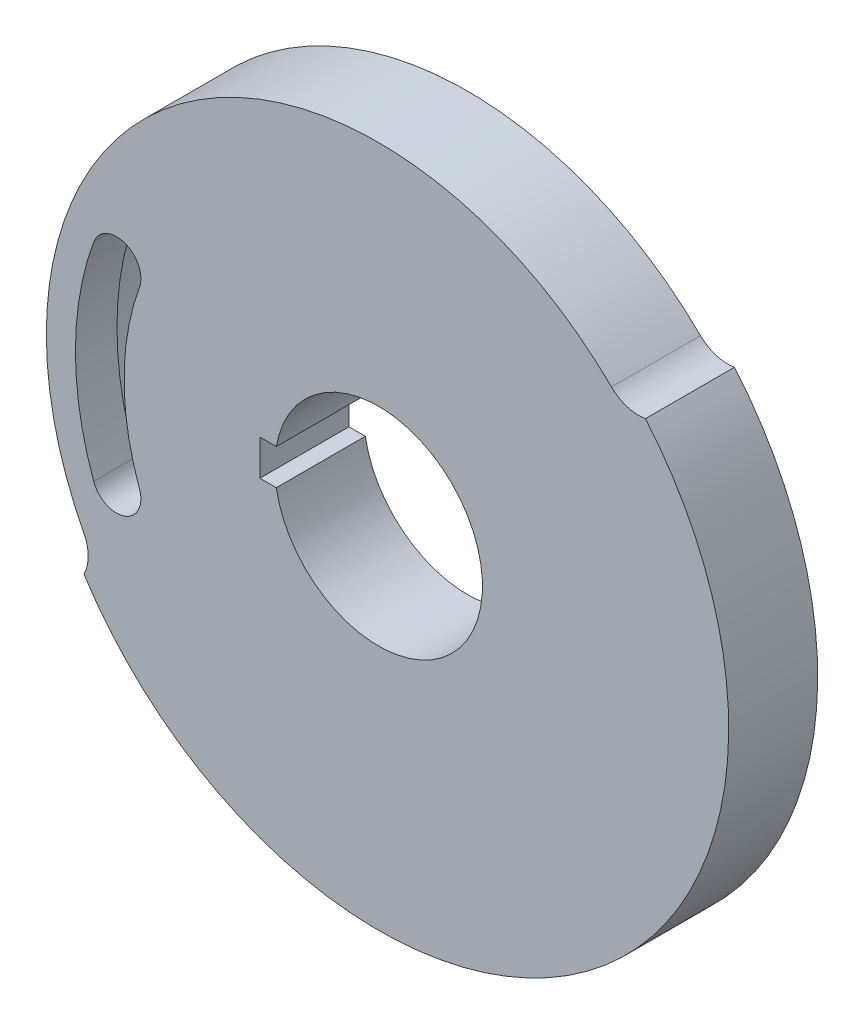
ISO-10303-21;
HEADER;
FILE_DESCRIPTION(('STEP AP214'),'2;1');
FILE_NAME('part.step','',(''),(''),'','','');
FILE_SCHEMA(('AUTOMOTIVE_DESIGN { 1 0 10303 214 1 1 1 1 }'));
ENDSEC;
DATA;
#1=APPLICATION_CONTEXT('core data for automotive mechanical design processes');
#2=APPLICATION_PROTOCOL_DEFINITION('international standard','automotive_design',2000,#1);
#3=PRODUCT_CONTEXT('',#1,'mechanical');
#4=PRODUCT('Part','Part','',(#3));
#5=PRODUCT_RELATED_PRODUCT_CATEGORY('part','',(#4));
#6=PRODUCT_DEFINITION_FORMATION('','',#4);
#7=PRODUCT_DEFINITION_CONTEXT('part definition',#1,'design');
#8=PRODUCT_DEFINITION('design','',#6,#7);
#9=PRODUCT_DEFINITION_SHAPE('','',#8);
#10=(LENGTH_UNIT() NAMED_UNIT(*) SI_UNIT(.MILLI.,.METRE.));
#11=(NAMED_UNIT(*) PLANE_ANGLE_UNIT() SI_UNIT($,.RADIAN.));
#12=(NAMED_UNIT(*) SI_UNIT($,.STERADIAN.) SOLID_ANGLE_UNIT());
#13=UNCERTAINTY_MEASURE_WITH_UNIT(LENGTH_MEASURE(1.E-05),#10,'distance_accuracy_value','');
#14=(GEOMETRIC_REPRESENTATION_CONTEXT(3) GLOBAL_UNCERTAINTY_ASSIGNED_CONTEXT((#13)) GLOBAL_UNIT_ASSIGNED_CONTEXT((#10,
#11,#12)) REPRESENTATION_CONTEXT('',''));
#15=CARTESIAN_POINT('',(0.,0.,0.));
#16=DIRECTION('',(0.,0.,1.));
#17=DIRECTION('',(1.,0.,0.));
#18=AXIS2_PLACEMENT_3D('',#15,#16,#17);
#19=CARTESIAN_POINT('',(0.,0.,15.));
#20=DIRECTION('',(0.,0.,-1.));
#21=DIRECTION('',(-1.00000000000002,0.,0.));
#22=AXIS2_PLACEMENT_3D('',#19,#20,#21);
#23=CYLINDRICAL_SURFACE('',#22,42.9);
#24=DIRECTION('',(0.,0.,-1.));
#25=VECTOR('',#24,1.);
#26=CARTESIAN_POINT('',(-40.312813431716,14.6726641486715,15.));
#27=LINE('',#26,#25);
#28=CARTESIAN_POINT('',(-40.312813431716,14.6726641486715,15.));
#29=VERTEX_POINT('',#28);
#30=CARTESIAN_POINT('',(-40.312813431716,14.6726641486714,7.99999999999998));
#31=VERTEX_POINT('',#30);
#32=EDGE_CURVE('E191',#29,#31,#27,.T.);
#33=ORIENTED_EDGE('',*,*,#32,.T.);
#34=CARTESIAN_POINT('',(0.,0.,8.00000000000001));
#35=DIRECTION('',(0.,0.,-1.));
#36=DIRECTION('',(-1.00000000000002,0.,0.));
#37=AXIS2_PLACEMENT_3D('',#34,#35,#36);
#38=CIRCLE('',#37,42.9);
#39=CARTESIAN_POINT('',(-40.312813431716,-14.6726641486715,8.00000000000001));
#40=VERTEX_POINT('',#39);
#41=EDGE_CURVE('E170',#31,#40,#38,.F.);
#42=ORIENTED_EDGE('',*,*,#41,.T.);
#43=DIRECTION('',(0.,0.,-1.));
#44=VECTOR('',#43,1.);
#45=CARTESIAN_POINT('',(-40.312813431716,-14.6726641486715,15.));
#46=LINE('',#45,#44);
#47=CARTESIAN_POINT('',(-40.312813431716,-14.6726641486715,15.));
#48=VERTEX_POINT('',#47);
#49=EDGE_CURVE('E182',#48,#40,#46,.T.);
#50=ORIENTED_EDGE('',*,*,#49,.F.);
#51=CARTESIAN_POINT('',(0.,0.,15.));
#52=DIRECTION('',(0.,0.,-1.));
#53=DIRECTION('',(1.00000000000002,0.,0.));
#54=AXIS2_PLACEMENT_3D('',#51,#52,#53);
#55=CIRCLE('',#54,42.9);
#56=EDGE_CURVE('E173',#48,#29,#55,.T.);
#57=ORIENTED_EDGE('',*,*,#56,.T.);
#58=EDGE_LOOP('',(#33,#42,#50,#57));
#59=FACE_BOUND('',#58,.T.);
#60=ADVANCED_FACE('F16',(#59),#23,.T.);
#61=CARTESIAN_POINT('',(-44.1655531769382,16.0749467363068,15.));
#62=DIRECTION('',(0.,0.,-1.));
#63=DIRECTION('',(-1.00000000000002,0.,0.));
#64=AXIS2_PLACEMENT_3D('',#61,#62,#63);
#65=CYLINDRICAL_SURFACE('',#64,4.1);
#66=DIRECTION('',(0.,0.,-1.));
#67=VECTOR('',#66,1.);
#68=CARTESIAN_POINT('',(-48.0182929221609,17.4772293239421,15.));
#69=LINE('',#68,#67);
#70=CARTESIAN_POINT('',(-48.0182929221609,17.4772293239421,15.));
#71=VERTEX_POINT('',#70);
#72=CARTESIAN_POINT('',(-48.0182929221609,17.4772293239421,7.99999999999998));
#73=VERTEX_POINT('',#72);
#74=EDGE_CURVE('E188',#71,#73,#69,.T.);
#75=ORIENTED_EDGE('',*,*,#74,.T.);
#76=CARTESIAN_POINT('',(-44.1655531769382,16.0749467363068,7.99999999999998));
#77=DIRECTION('',(0.,0.,-1.));
#78=DIRECTION('',(-1.00000000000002,0.,0.));
#79=AXIS2_PLACEMENT_3D('',#76,#77,#78);
#80=CIRCLE('',#79,4.1);
#81=EDGE_CURVE('E167',#73,#31,#80,.T.);
#82=ORIENTED_EDGE('',*,*,#81,.T.);
#83=ORIENTED_EDGE('',*,*,#32,.F.);
#84=CARTESIAN_POINT('',(-44.1655531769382,16.0749467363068,15.));
#85=DIRECTION('',(0.,0.,1.));
#86=DIRECTION('',(1.00000000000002,0.,0.));
#87=AXIS2_PLACEMENT_3D('',#84,#85,#86);
#88=CIRCLE('',#87,4.1);
#89=EDGE_CURVE('E175',#29,#71,#88,.T.);
#90=ORIENTED_EDGE('',*,*,#89,.T.);
#91=EDGE_LOOP('',(#75,#82,#83,#90));
#92=FACE_BOUND('',#91,.T.);
#93=ADVANCED_FACE('F285',(#92),#65,.F.);
#94=CARTESIAN_POINT('',(0.,0.,15.));
#95=DIRECTION('',(0.,0.,-1.));
#96=DIRECTION('',(-1.00000000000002,0.,0.));
#97=AXIS2_PLACEMENT_3D('',#94,#95,#96);
#98=CYLINDRICAL_SURFACE('',#97,51.1);
#99=DIRECTION('',(0.,0.,-1.));
#100=VECTOR('',#99,1.);
#101=CARTESIAN_POINT('',(-48.0182929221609,-17.4772293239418,15.));
#102=LINE('',#101,#100);
#103=CARTESIAN_POINT('',(-48.0182929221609,-17.4772293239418,15.));
#104=VERTEX_POINT('',#103);
#105=CARTESIAN_POINT('',(-48.0182929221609,-17.4772293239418,8.00000000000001));
#106=VERTEX_POINT('',#105);
#107=EDGE_CURVE('E185',#104,#106,#102,.T.);
#108=ORIENTED_EDGE('',*,*,#107,.T.);
#109=CARTESIAN_POINT('',(0.,0.,8.00000000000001));
#110=DIRECTION('',(0.,0.,-1.));
#111=DIRECTION('',(-1.00000000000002,0.,0.));
#112=AXIS2_PLACEMENT_3D('',#109,#110,#111);
#113=CIRCLE('',#112,51.1);
#114=EDGE_CURVE('E39',#106,#73,#113,.T.);
#115=ORIENTED_EDGE('',*,*,#114,.T.);
#116=ORIENTED_EDGE('',*,*,#74,.F.);
#117=CARTESIAN_POINT('',(0.,0.,15.));
#118=DIRECTION('',(0.,0.,1.));
#119=DIRECTION('',(1.00000000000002,0.,0.));
#120=AXIS2_PLACEMENT_3D('',#117,#118,#119);
#121=CIRCLE('',#120,51.1);
#122=EDGE_CURVE('E177',#71,#104,#121,.T.);
#123=ORIENTED_EDGE('',*,*,#122,.T.);
#124=EDGE_LOOP('',(#108,#115,#116,#123));
#125=FACE_BOUND('',#124,.T.);
#126=ADVANCED_FACE('F287',(#125),#98,.F.);
#127=CARTESIAN_POINT('',(-44.1655531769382,-16.0749467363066,15.));
#128=DIRECTION('',(0.,0.,-1.));
#129=DIRECTION('',(-1.00000000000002,0.,0.));
#130=AXIS2_PLACEMENT_3D('',#127,#128,#129);
#131=CYLINDRICAL_SURFACE('',#130,4.1);
#132=ORIENTED_EDGE('',*,*,#49,.T.);
#133=CARTESIAN_POINT('',(-44.1655531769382,-16.0749467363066,8.00000000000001));
#134=DIRECTION('',(0.,0.,-1.));
#135=DIRECTION('',(-1.00000000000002,0.,0.));
#136=AXIS2_PLACEMENT_3D('',#133,#134,#135);
#137=CIRCLE('',#136,4.1);
#138=EDGE_CURVE('E11',#40,#106,#137,.T.);
#139=ORIENTED_EDGE('',*,*,#138,.T.);
#140=ORIENTED_EDGE('',*,*,#107,.F.);
#141=CARTESIAN_POINT('',(-44.1655531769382,-16.0749467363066,15.));
#142=DIRECTION('',(0.,0.,1.));
#143=DIRECTION('',(1.00000000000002,0.,0.));
#144=AXIS2_PLACEMENT_3D('',#141,#142,#143);
#145=CIRCLE('',#144,4.1);
#146=EDGE_CURVE('E180',#104,#48,#145,.T.);
#147=ORIENTED_EDGE('',*,*,#146,.T.);
#148=EDGE_LOOP('',(#132,#139,#140,#147));
#149=FACE_BOUND('',#148,.T.);
#150=ADVANCED_FACE('F275',(#149),#131,.F.);
#151=CARTESIAN_POINT('',(-27.71908853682,-14.4296441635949,15.));
#152=DIRECTION('',(0.,0.,1.));
#153=DIRECTION('',(1.00000000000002,0.,0.));
#154=AXIS2_PLACEMENT_3D('',#151,#152,#153);
#155=PLANE('',#154);
#156=DIRECTION('',(1.00000000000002,0.,0.));
#157=VECTOR('',#156,1.);
#158=CARTESIAN_POINT('',(-20.0000000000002,-3.00000000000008,15.));
#159=LINE('',#158,#157);
#160=CARTESIAN_POINT('',(-20.0000000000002,-3.00000000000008,15.));
#161=VERTEX_POINT('',#160);
#162=CARTESIAN_POINT('',(-17.2409396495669,-3.00000000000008,15.));
#163=VERTEX_POINT('',#162);
#164=EDGE_CURVE('E197',#161,#163,#159,.T.);
#165=ORIENTED_EDGE('',*,*,#164,.F.);
#166=DIRECTION('',(0.,-1.00000000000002,0.));
#167=VECTOR('',#166,1.);
#168=CARTESIAN_POINT('',(-20.0000000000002,-3.00000000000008,15.));
#169=LINE('',#168,#167);
#170=CARTESIAN_POINT('',(-20.0000000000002,3.00000000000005,15.));
#171=VERTEX_POINT('',#170);
#172=EDGE_CURVE('E195',#171,#161,#169,.T.);
#173=ORIENTED_EDGE('',*,*,#172,.F.);
#174=DIRECTION('',(-1.00000000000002,0.,0.));
#175=VECTOR('',#174,1.);
#176=CARTESIAN_POINT('',(-20.0000000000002,3.00000000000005,15.));
#177=LINE('',#176,#175);
#178=CARTESIAN_POINT('',(-17.240939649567,3.00000000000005,15.));
#179=VERTEX_POINT('',#178);
#180=EDGE_CURVE('E203',#179,#171,#177,.T.);
#181=ORIENTED_EDGE('',*,*,#180,.F.);
#182=CARTESIAN_POINT('',(0.,0.,15.));
#183=DIRECTION('',(0.,0.,1.));
#184=DIRECTION('',(1.00000000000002,0.,0.));
#185=AXIS2_PLACEMENT_3D('',#182,#183,#184);
#186=CIRCLE('',#185,17.5);
#187=EDGE_CURVE('E200',#163,#179,#186,.T.);
#188=ORIENTED_EDGE('',*,*,#187,.F.);
#189=EDGE_LOOP('',(#165,#173,#181,#188));
#190=FACE_BOUND('',#189,.T.);
#191=CARTESIAN_POINT('',(-55.43817707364,-28.8592883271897,15.));
#192=DIRECTION('',(0.,0.,-1.));
#193=DIRECTION('',(1.00000000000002,0.,0.));
#194=AXIS2_PLACEMENT_3D('',#191,#192,#193);
#195=CIRCLE('',#194,6.5);
#196=CARTESIAN_POINT('',(-49.6726066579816,-25.857922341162,15.));
#197=VERTEX_POINT('',#196);
#198=CARTESIAN_POINT('',(-49.6659904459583,-31.8479103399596,15.));
#199=VERTEX_POINT('',#198);
#200=EDGE_CURVE('E226',#197,#199,#195,.T.);
#201=ORIENTED_EDGE('',*,*,#200,.T.);
#202=CARTESIAN_POINT('',(0.,0.,15.));
#203=DIRECTION('',(0.,0.,1.));
#204=DIRECTION('',(1.00000000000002,0.,0.));
#205=AXIS2_PLACEMENT_3D('',#202,#203,#204);
#206=CIRCLE('',#205,59.);
#207=CARTESIAN_POINT('',(44.9772384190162,38.1843950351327,15.));
#208=VERTEX_POINT('',#207);
#209=EDGE_CURVE('E229',#199,#208,#206,.T.);
#210=ORIENTED_EDGE('',*,*,#209,.T.);
#211=CARTESIAN_POINT('',(43.8068290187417,44.5781530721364,15.));
#212=DIRECTION('',(0.,0.,-1.));
#213=DIRECTION('',(1.00000000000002,0.,0.));
#214=AXIS2_PLACEMENT_3D('',#211,#212,#213);
#215=CIRCLE('',#214,6.5);
#216=CARTESIAN_POINT('',(39.2509188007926,39.9420251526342,15.));
#217=VERTEX_POINT('',#216);
#218=EDGE_CURVE('E232',#208,#217,#215,.T.);
#219=ORIENTED_EDGE('',*,*,#218,.T.);
#220=CARTESIAN_POINT('',(0.,0.,15.));
#221=DIRECTION('',(0.,0.,1.));
#222=DIRECTION('',(1.00000000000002,0.,0.));
#223=AXIS2_PLACEMENT_3D('',#220,#221,#222);
#224=CIRCLE('',#223,56.);
#225=EDGE_CURVE('E234',#217,#197,#224,.T.);
#226=ORIENTED_EDGE('',*,*,#225,.T.);
#227=EDGE_LOOP('',(#201,#210,#219,#226));
#228=FACE_BOUND('',#227,.T.);
#229=ORIENTED_EDGE('',*,*,#89,.F.);
#230=ORIENTED_EDGE('',*,*,#56,.F.);
#231=ORIENTED_EDGE('',*,*,#146,.F.);
#232=ORIENTED_EDGE('',*,*,#122,.F.);
#233=EDGE_LOOP('',(#229,#230,#231,#232));
#234=FACE_BOUND('',#233,.T.);
#235=ADVANCED_FACE('F272',(#190,#228,#234),#155,.T.);
#236=CARTESIAN_POINT('',(-27.71908853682,-14.4296441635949,0.));
#237=DIRECTION('',(0.,0.,1.));
#238=DIRECTION('',(1.00000000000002,0.,0.));
#239=AXIS2_PLACEMENT_3D('',#236,#237,#238);
#240=PLANE('',#239);
#241=CARTESIAN_POINT('',(-42.596465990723,-19.863058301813,0.));
#242=DIRECTION('',(0.,0.,-1.));
#243=DIRECTION('',(-1.00000000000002,0.,0.));
#244=AXIS2_PLACEMENT_3D('',#241,#242,#243);
#245=CIRCLE('',#244,6.75);
#246=CARTESIAN_POINT('',(-36.4788884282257,-17.0103850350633,0.));
#247=VERTEX_POINT('',#246);
#248=CARTESIAN_POINT('',(-48.7140435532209,-22.7157315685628,0.));
#249=VERTEX_POINT('',#248);
#250=EDGE_CURVE('E157',#247,#249,#245,.T.);
#251=ORIENTED_EDGE('',*,*,#250,.F.);
#252=CARTESIAN_POINT('',(0.,0.,0.));
#253=DIRECTION('',(0.,0.,1.));
#254=DIRECTION('',(-1.00000000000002,0.,0.));
#255=AXIS2_PLACEMENT_3D('',#252,#253,#254);
#256=CIRCLE('',#255,40.25);
#257=CARTESIAN_POINT('',(-36.4788884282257,17.0103850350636,0.));
#258=VERTEX_POINT('',#257);
#259=EDGE_CURVE('E31',#258,#247,#256,.T.);
#260=ORIENTED_EDGE('',*,*,#259,.F.);
#261=CARTESIAN_POINT('',(-42.596465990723,19.8630583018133,0.));
#262=DIRECTION('',(0.,0.,-1.));
#263=DIRECTION('',(-1.00000000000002,0.,0.));
#264=AXIS2_PLACEMENT_3D('',#261,#262,#263);
#265=CIRCLE('',#264,6.75);
#266=CARTESIAN_POINT('',(-48.7140435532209,22.715731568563,0.));
#267=VERTEX_POINT('',#266);
#268=EDGE_CURVE('E148',#267,#258,#265,.T.);
#269=ORIENTED_EDGE('',*,*,#268,.F.);
#270=CARTESIAN_POINT('',(0.,0.,0.));
#271=DIRECTION('',(0.,0.,-1.));
#272=DIRECTION('',(-1.00000000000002,0.,0.));
#273=AXIS2_PLACEMENT_3D('',#270,#271,#272);
#274=CIRCLE('',#273,53.75);
#275=EDGE_CURVE('E151',#249,#267,#274,.T.);
#276=ORIENTED_EDGE('',*,*,#275,.F.);
#277=EDGE_LOOP('',(#251,#260,#269,#276));
#278=FACE_BOUND('',#277,.T.);
#279=DIRECTION('',(0.,-1.00000000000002,0.));
#280=VECTOR('',#279,1.);
#281=CARTESIAN_POINT('',(-20.0000000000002,-3.00000000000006,0.));
#282=LINE('',#281,#280);
#283=CARTESIAN_POINT('',(-20.0000000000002,3.00000000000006,0.));
#284=VERTEX_POINT('',#283);
#285=CARTESIAN_POINT('',(-20.0000000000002,-3.00000000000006,0.));
#286=VERTEX_POINT('',#285);
#287=EDGE_CURVE('E194',#284,#286,#282,.T.);
#288=ORIENTED_EDGE('',*,*,#287,.T.);
#289=DIRECTION('',(1.00000000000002,0.,0.));
#290=VECTOR('',#289,1.);
#291=CARTESIAN_POINT('',(-20.0000000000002,-3.00000000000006,0.));
#292=LINE('',#291,#290);
#293=CARTESIAN_POINT('',(-17.2409396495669,-3.00000000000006,0.));
#294=VERTEX_POINT('',#293);
#295=EDGE_CURVE('E208',#286,#294,#292,.T.);
#296=ORIENTED_EDGE('',*,*,#295,.T.);
#297=CARTESIAN_POINT('',(0.,0.,0.));
#298=DIRECTION('',(0.,0.,1.));
#299=DIRECTION('',(1.00000000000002,0.,0.));
#300=AXIS2_PLACEMENT_3D('',#297,#298,#299);
#301=CIRCLE('',#300,17.5);
#302=CARTESIAN_POINT('',(-17.240939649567,3.00000000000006,0.));
#303=VERTEX_POINT('',#302);
#304=EDGE_CURVE('E211',#294,#303,#301,.T.);
#305=ORIENTED_EDGE('',*,*,#304,.T.);
#306=DIRECTION('',(-1.00000000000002,0.,0.));
#307=VECTOR('',#306,1.);
#308=CARTESIAN_POINT('',(-20.0000000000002,3.00000000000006,0.));
#309=LINE('',#308,#307);
#310=EDGE_CURVE('E198',#303,#284,#309,.T.);
#311=ORIENTED_EDGE('',*,*,#310,.T.);
#312=EDGE_LOOP('',(#288,#296,#305,#311));
#313=FACE_BOUND('',#312,.T.);
#314=CARTESIAN_POINT('',(-55.43817707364,-28.8592883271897,0.));
#315=DIRECTION('',(0.,0.,-1.));
#316=DIRECTION('',(1.00000000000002,0.,0.));
#317=AXIS2_PLACEMENT_3D('',#314,#315,#316);
#318=CIRCLE('',#317,6.5);
#319=CARTESIAN_POINT('',(-49.6726066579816,-25.857922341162,0.));
#320=VERTEX_POINT('',#319);
#321=CARTESIAN_POINT('',(-49.6659904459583,-31.8479103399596,0.));
#322=VERTEX_POINT('',#321);
#323=EDGE_CURVE('E225',#320,#322,#318,.T.);
#324=ORIENTED_EDGE('',*,*,#323,.F.);
#325=CARTESIAN_POINT('',(0.,0.,0.));
#326=DIRECTION('',(0.,0.,1.));
#327=DIRECTION('',(1.00000000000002,0.,0.));
#328=AXIS2_PLACEMENT_3D('',#325,#326,#327);
#329=CIRCLE('',#328,56.);
#330=CARTESIAN_POINT('',(39.2509188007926,39.9420251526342,0.));
#331=VERTEX_POINT('',#330);
#332=EDGE_CURVE('E230',#331,#320,#329,.T.);
#333=ORIENTED_EDGE('',*,*,#332,.F.);
#334=CARTESIAN_POINT('',(43.8068290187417,44.5781530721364,0.));
#335=DIRECTION('',(0.,0.,-1.));
#336=DIRECTION('',(1.00000000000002,0.,0.));
#337=AXIS2_PLACEMENT_3D('',#334,#335,#336);
#338=CIRCLE('',#337,6.5);
#339=CARTESIAN_POINT('',(44.9772384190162,38.1843950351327,0.));
#340=VERTEX_POINT('',#339);
#341=EDGE_CURVE('E241',#340,#331,#338,.T.);
#342=ORIENTED_EDGE('',*,*,#341,.F.);
#343=CARTESIAN_POINT('',(0.,0.,0.));
#344=DIRECTION('',(0.,0.,1.));
#345=DIRECTION('',(1.00000000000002,0.,0.));
#346=AXIS2_PLACEMENT_3D('',#343,#344,#345);
#347=CIRCLE('',#346,59.);
#348=EDGE_CURVE('E239',#322,#340,#347,.T.);
#349=ORIENTED_EDGE('',*,*,#348,.F.);
#350=EDGE_LOOP('',(#324,#333,#342,#349));
#351=FACE_BOUND('',#350,.T.);
#352=ADVANCED_FACE('F262',(#278,#313,#351),#240,.F.);
#353=CARTESIAN_POINT('',(-55.43817707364,-28.8592883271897,15.));
#354=DIRECTION('',(0.,0.,-1.));
#355=DIRECTION('',(-1.00000000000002,0.,0.));
#356=AXIS2_PLACEMENT_3D('',#353,#354,#355);
#357=CYLINDRICAL_SURFACE('',#356,6.5);
#358=ORIENTED_EDGE('',*,*,#323,.T.);
#359=DIRECTION('',(0.,0.,-1.));
#360=VECTOR('',#359,1.);
#361=CARTESIAN_POINT('',(-49.6659904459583,-31.8479103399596,15.));
#362=LINE('',#361,#360);
#363=EDGE_CURVE('E24',#199,#322,#362,.T.);
#364=ORIENTED_EDGE('',*,*,#363,.F.);
#365=ORIENTED_EDGE('',*,*,#200,.F.);
#366=DIRECTION('',(0.,0.,-1.));
#367=VECTOR('',#366,1.);
#368=CARTESIAN_POINT('',(-49.6726066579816,-25.857922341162,15.));
#369=LINE('',#368,#367);
#370=EDGE_CURVE('E236',#197,#320,#369,.T.);
#371=ORIENTED_EDGE('',*,*,#370,.T.);
#372=EDGE_LOOP('',(#358,#364,#365,#371));
#373=FACE_BOUND('',#372,.T.);
#374=ADVANCED_FACE('F18',(#373),#357,.F.);
#375=CARTESIAN_POINT('',(0.,0.,15.));
#376=DIRECTION('',(0.,0.,-1.));
#377=DIRECTION('',(-1.00000000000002,0.,0.));
#378=AXIS2_PLACEMENT_3D('',#375,#376,#377);
#379=CYLINDRICAL_SURFACE('',#378,59.);
#380=ORIENTED_EDGE('',*,*,#348,.T.);
#381=DIRECTION('',(0.,0.,-1.));
#382=VECTOR('',#381,1.);
#383=CARTESIAN_POINT('',(44.9772384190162,38.1843950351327,15.));
#384=LINE('',#383,#382);
#385=EDGE_CURVE('E249',#208,#340,#384,.T.);
#386=ORIENTED_EDGE('',*,*,#385,.F.);
#387=ORIENTED_EDGE('',*,*,#209,.F.);
#388=ORIENTED_EDGE('',*,*,#363,.T.);
#389=EDGE_LOOP('',(#380,#386,#387,#388));
#390=FACE_BOUND('',#389,.T.);
#391=ADVANCED_FACE('F254',(#390),#379,.T.);
#392=CARTESIAN_POINT('',(43.8068290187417,44.5781530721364,15.));
#393=DIRECTION('',(0.,0.,-1.));
#394=DIRECTION('',(-1.00000000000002,0.,0.));
#395=AXIS2_PLACEMENT_3D('',#392,#393,#394);
#396=CYLINDRICAL_SURFACE('',#395,6.5);
#397=ORIENTED_EDGE('',*,*,#341,.T.);
#398=DIRECTION('',(0.,0.,-1.));
#399=VECTOR('',#398,1.);
#400=CARTESIAN_POINT('',(39.2509188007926,39.9420251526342,15.));
#401=LINE('',#400,#399);
#402=EDGE_CURVE('E246',#217,#331,#401,.T.);
#403=ORIENTED_EDGE('',*,*,#402,.F.);
#404=ORIENTED_EDGE('',*,*,#218,.F.);
#405=ORIENTED_EDGE('',*,*,#385,.T.);
#406=EDGE_LOOP('',(#397,#403,#404,#405));
#407=FACE_BOUND('',#406,.T.);
#408=ADVANCED_FACE('F266',(#407),#396,.F.);
#409=CARTESIAN_POINT('',(0.,0.,15.));
#410=DIRECTION('',(0.,0.,-1.));
#411=DIRECTION('',(-1.00000000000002,0.,0.));
#412=AXIS2_PLACEMENT_3D('',#409,#410,#411);
#413=CYLINDRICAL_SURFACE('',#412,56.);
#414=ORIENTED_EDGE('',*,*,#332,.T.);
#415=ORIENTED_EDGE('',*,*,#370,.F.);
#416=ORIENTED_EDGE('',*,*,#225,.F.);
#417=ORIENTED_EDGE('',*,*,#402,.T.);
#418=EDGE_LOOP('',(#414,#415,#416,#417));
#419=FACE_BOUND('',#418,.T.);
#420=ADVANCED_FACE('F270',(#419),#413,.T.);
#421=CARTESIAN_POINT('',(-20.0000000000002,-3.00000000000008,15.));
#422=DIRECTION('',(1.00000000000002,0.,0.));
#423=DIRECTION('',(0.,0.,-1.));
#424=AXIS2_PLACEMENT_3D('',#421,#422,#423);
#425=PLANE('',#424);
#426=ORIENTED_EDGE('',*,*,#287,.F.);
#427=DIRECTION('',(0.,0.,-1.));
#428=VECTOR('',#427,1.);
#429=CARTESIAN_POINT('',(-20.0000000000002,3.00000000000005,15.));
#430=LINE('',#429,#428);
#431=EDGE_CURVE('E205',#171,#284,#430,.T.);
#432=ORIENTED_EDGE('',*,*,#431,.F.);
#433=ORIENTED_EDGE('',*,*,#172,.T.);
#434=DIRECTION('',(0.,0.,-1.));
#435=VECTOR('',#434,1.);
#436=CARTESIAN_POINT('',(-20.0000000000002,-3.00000000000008,15.));
#437=LINE('',#436,#435);
#438=EDGE_CURVE('E222',#161,#286,#437,.T.);
#439=ORIENTED_EDGE('',*,*,#438,.T.);
#440=EDGE_LOOP('',(#426,#432,#433,#439));
#441=FACE_BOUND('',#440,.T.);
#442=ADVANCED_FACE('F311',(#441),#425,.T.);
#443=CARTESIAN_POINT('',(-20.0000000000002,-3.00000000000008,15.));
#444=DIRECTION('',(0.,1.00000000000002,0.));
#445=DIRECTION('',(0.,0.,1.));
#446=AXIS2_PLACEMENT_3D('',#443,#444,#445);
#447=PLANE('',#446);
#448=ORIENTED_EDGE('',*,*,#295,.F.);
#449=ORIENTED_EDGE('',*,*,#438,.F.);
#450=ORIENTED_EDGE('',*,*,#164,.T.);
#451=DIRECTION('',(0.,0.,-1.));
#452=VECTOR('',#451,1.);
#453=CARTESIAN_POINT('',(-17.2409396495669,-3.00000000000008,15.));
#454=LINE('',#453,#452);
#455=EDGE_CURVE('E220',#163,#294,#454,.T.);
#456=ORIENTED_EDGE('',*,*,#455,.T.);
#457=EDGE_LOOP('',(#448,#449,#450,#456));
#458=FACE_BOUND('',#457,.T.);
#459=ADVANCED_FACE('F307',(#458),#447,.T.);
#460=CARTESIAN_POINT('',(0.,0.,15.));
#461=DIRECTION('',(0.,0.,-1.));
#462=DIRECTION('',(-1.00000000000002,0.,0.));
#463=AXIS2_PLACEMENT_3D('',#460,#461,#462);
#464=CYLINDRICAL_SURFACE('',#463,17.5);
#465=ORIENTED_EDGE('',*,*,#304,.F.);
#466=ORIENTED_EDGE('',*,*,#455,.F.);
#467=ORIENTED_EDGE('',*,*,#187,.T.);
#468=DIRECTION('',(0.,0.,-1.));
#469=VECTOR('',#468,1.);
#470=CARTESIAN_POINT('',(-17.240939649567,3.00000000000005,15.));
#471=LINE('',#470,#469);
#472=EDGE_CURVE('E218',#179,#303,#471,.T.);
#473=ORIENTED_EDGE('',*,*,#472,.T.);
#474=EDGE_LOOP('',(#465,#466,#467,#473));
#475=FACE_BOUND('',#474,.T.);
#476=ADVANCED_FACE('F303',(#475),#464,.F.);
#477=CARTESIAN_POINT('',(-20.0000000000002,3.00000000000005,15.));
#478=DIRECTION('',(0.,-1.00000000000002,0.));
#479=DIRECTION('',(0.,0.,-1.));
#480=AXIS2_PLACEMENT_3D('',#477,#478,#479);
#481=PLANE('',#480);
#482=ORIENTED_EDGE('',*,*,#310,.F.);
#483=ORIENTED_EDGE('',*,*,#472,.F.);
#484=ORIENTED_EDGE('',*,*,#180,.T.);
#485=ORIENTED_EDGE('',*,*,#431,.T.);
#486=EDGE_LOOP('',(#482,#483,#484,#485));
#487=FACE_BOUND('',#486,.T.);
#488=ADVANCED_FACE('F300',(#487),#481,.T.);
#489=CARTESIAN_POINT('',(0.,0.,8.00000000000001));
#490=DIRECTION('',(0.,0.,-1.));
#491=DIRECTION('',(-1.00000000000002,0.,0.));
#492=AXIS2_PLACEMENT_3D('',#489,#490,#491);
#493=CYLINDRICAL_SURFACE('',#492,40.25);
#494=ORIENTED_EDGE('',*,*,#259,.T.);
#495=DIRECTION('',(0.,0.,-1.));
#496=VECTOR('',#495,1.);
#497=CARTESIAN_POINT('',(-36.4788884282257,-17.0103850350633,8.00000000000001));
#498=LINE('',#497,#496);
#499=CARTESIAN_POINT('',(-36.4788884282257,-17.0103850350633,8.00000000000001));
#500=VERTEX_POINT('',#499);
#501=EDGE_CURVE('E126',#500,#247,#498,.T.);
#502=ORIENTED_EDGE('',*,*,#501,.F.);
#503=CARTESIAN_POINT('',(0.,0.,8.00000000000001));
#504=DIRECTION('',(0.,0.,1.));
#505=DIRECTION('',(-1.00000000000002,0.,0.));
#506=AXIS2_PLACEMENT_3D('',#503,#504,#505);
#507=CIRCLE('',#506,40.25);
#508=CARTESIAN_POINT('',(-36.4788884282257,17.0103850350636,7.99999999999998));
#509=VERTEX_POINT('',#508);
#510=EDGE_CURVE('E130',#509,#500,#507,.T.);
#511=ORIENTED_EDGE('',*,*,#510,.F.);
#512=DIRECTION('',(0.,0.,-1.));
#513=VECTOR('',#512,1.);
#514=CARTESIAN_POINT('',(-36.4788884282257,17.0103850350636,7.99999999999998));
#515=LINE('',#514,#513);
#516=EDGE_CURVE('E161',#509,#258,#515,.T.);
#517=ORIENTED_EDGE('',*,*,#516,.T.);
#518=EDGE_LOOP('',(#494,#502,#511,#517));
#519=FACE_BOUND('',#518,.T.);
#520=ADVANCED_FACE('F128',(#519),#493,.T.);
#521=CARTESIAN_POINT('',(-42.596465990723,19.8630583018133,7.99999999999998));
#522=DIRECTION('',(0.,0.,-1.));
#523=DIRECTION('',(-1.00000000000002,0.,0.));
#524=AXIS2_PLACEMENT_3D('',#521,#522,#523);
#525=CYLINDRICAL_SURFACE('',#524,6.75);
#526=ORIENTED_EDGE('',*,*,#268,.T.);
#527=ORIENTED_EDGE('',*,*,#516,.F.);
#528=CARTESIAN_POINT('',(-42.596465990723,19.8630583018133,7.99999999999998));
#529=DIRECTION('',(0.,0.,-1.));
#530=DIRECTION('',(-1.00000000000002,0.,0.));
#531=AXIS2_PLACEMENT_3D('',#528,#529,#530);
#532=CIRCLE('',#531,6.75);
#533=CARTESIAN_POINT('',(-48.7140435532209,22.715731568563,7.99999999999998));
#534=VERTEX_POINT('',#533);
#535=EDGE_CURVE('E136',#534,#509,#532,.T.);
#536=ORIENTED_EDGE('',*,*,#535,.F.);
#537=DIRECTION('',(0.,0.,-1.));
#538=VECTOR('',#537,1.);
#539=CARTESIAN_POINT('',(-48.7140435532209,22.715731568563,7.99999999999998));
#540=LINE('',#539,#538);
#541=EDGE_CURVE('E163',#534,#267,#540,.T.);
#542=ORIENTED_EDGE('',*,*,#541,.T.);
#543=EDGE_LOOP('',(#526,#527,#536,#542));
#544=FACE_BOUND('',#543,.T.);
#545=ADVANCED_FACE('F346',(#544),#525,.F.);
#546=CARTESIAN_POINT('',(0.,0.,8.00000000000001));
#547=DIRECTION('',(0.,0.,-1.));
#548=DIRECTION('',(-1.00000000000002,0.,0.));
#549=AXIS2_PLACEMENT_3D('',#546,#547,#548);
#550=CYLINDRICAL_SURFACE('',#549,53.75);
#551=ORIENTED_EDGE('',*,*,#275,.T.);
#552=ORIENTED_EDGE('',*,*,#541,.F.);
#553=CARTESIAN_POINT('',(0.,0.,8.00000000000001));
#554=DIRECTION('',(0.,0.,-1.));
#555=DIRECTION('',(-1.00000000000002,0.,0.));
#556=AXIS2_PLACEMENT_3D('',#553,#554,#555);
#557=CIRCLE('',#556,53.75);
#558=CARTESIAN_POINT('',(-48.7140435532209,-22.7157315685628,8.00000000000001));
#559=VERTEX_POINT('',#558);
#560=EDGE_CURVE('E144',#559,#534,#557,.T.);
#561=ORIENTED_EDGE('',*,*,#560,.F.);
#562=DIRECTION('',(0.,0.,-1.));
#563=VECTOR('',#562,1.);
#564=CARTESIAN_POINT('',(-48.7140435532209,-22.7157315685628,8.00000000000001));
#565=LINE('',#564,#563);
#566=EDGE_CURVE('E135',#559,#249,#565,.T.);
#567=ORIENTED_EDGE('',*,*,#566,.T.);
#568=EDGE_LOOP('',(#551,#552,#561,#567));
#569=FACE_BOUND('',#568,.T.);
#570=ADVANCED_FACE('F349',(#569),#550,.F.);
#571=CARTESIAN_POINT('',(-42.596465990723,-19.863058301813,8.00000000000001));
#572=DIRECTION('',(0.,0.,-1.));
#573=DIRECTION('',(-1.00000000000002,0.,0.));
#574=AXIS2_PLACEMENT_3D('',#571,#572,#573);
#575=CYLINDRICAL_SURFACE('',#574,6.75);
#576=ORIENTED_EDGE('',*,*,#250,.T.);
#577=ORIENTED_EDGE('',*,*,#566,.F.);
#578=CARTESIAN_POINT('',(-42.596465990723,-19.863058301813,8.00000000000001));
#579=DIRECTION('',(0.,0.,-1.));
#580=DIRECTION('',(-1.00000000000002,0.,0.));
#581=AXIS2_PLACEMENT_3D('',#578,#579,#580);
#582=CIRCLE('',#581,6.75);
#583=EDGE_CURVE('E139',#500,#559,#582,.T.);
#584=ORIENTED_EDGE('',*,*,#583,.F.);
#585=ORIENTED_EDGE('',*,*,#501,.T.);
#586=EDGE_LOOP('',(#576,#577,#584,#585));
#587=FACE_BOUND('',#586,.T.);
#588=ADVANCED_FACE('F140',(#587),#575,.F.);
#589=CARTESIAN_POINT('',(-21.2982329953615,9.93152915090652,8.00000000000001));
#590=DIRECTION('',(0.,0.,-1.));
#591=DIRECTION('',(-1.00000000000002,0.,0.));
#592=AXIS2_PLACEMENT_3D('',#589,#590,#591);
#593=PLANE('',#592);
#594=ORIENTED_EDGE('',*,*,#81,.F.);
#595=ORIENTED_EDGE('',*,*,#114,.F.);
#596=ORIENTED_EDGE('',*,*,#138,.F.);
#597=ORIENTED_EDGE('',*,*,#41,.F.);
#598=EDGE_LOOP('',(#594,#595,#596,#597));
#599=FACE_BOUND('',#598,.T.);
#600=ORIENTED_EDGE('',*,*,#510,.T.);
#601=ORIENTED_EDGE('',*,*,#583,.T.);
#602=ORIENTED_EDGE('',*,*,#560,.T.);
#603=ORIENTED_EDGE('',*,*,#535,.T.);
#604=EDGE_LOOP('',(#600,#601,#602,#603));
#605=FACE_BOUND('',#604,.T.);
#606=ADVANCED_FACE('F146',(#599,#605),#593,.T.);
#607=CLOSED_SHELL('',(#60,#93,#126,#150,#235,#352,#374,#391,#408,#420,#442,#459,#476,#488,#520,
#545,#570,#588,#606));
#608=MANIFOLD_SOLID_BREP('B1',#607);
#609=ADVANCED_BREP_SHAPE_REPRESENTATION('',(#18,#608),#14);
#610=SHAPE_DEFINITION_REPRESENTATION(#9,#609);
ENDSEC;
END-ISO-10303-21;
